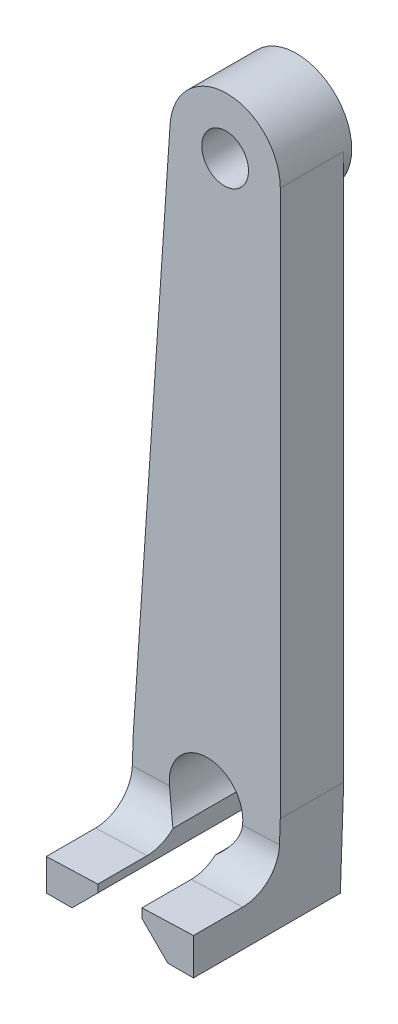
ISO-10303-21;
HEADER;
FILE_DESCRIPTION(('STEP AP214'),'2;1');
FILE_NAME('part.step','',(''),(''),'','','');
FILE_SCHEMA(('AUTOMOTIVE_DESIGN { 1 0 10303 214 1 1 1 1 }'));
ENDSEC;
DATA;
#1=APPLICATION_CONTEXT('core data for automotive mechanical design processes');
#2=APPLICATION_PROTOCOL_DEFINITION('international standard','automotive_design',2000,#1);
#3=PRODUCT_CONTEXT('',#1,'mechanical');
#4=PRODUCT('Part','Part','',(#3));
#5=PRODUCT_RELATED_PRODUCT_CATEGORY('part','',(#4));
#6=PRODUCT_DEFINITION_FORMATION('','',#4);
#7=PRODUCT_DEFINITION_CONTEXT('part definition',#1,'design');
#8=PRODUCT_DEFINITION('design','',#6,#7);
#9=PRODUCT_DEFINITION_SHAPE('','',#8);
#10=(LENGTH_UNIT() NAMED_UNIT(*) SI_UNIT(.MILLI.,.METRE.));
#11=(NAMED_UNIT(*) PLANE_ANGLE_UNIT() SI_UNIT($,.RADIAN.));
#12=(NAMED_UNIT(*) SI_UNIT($,.STERADIAN.) SOLID_ANGLE_UNIT());
#13=UNCERTAINTY_MEASURE_WITH_UNIT(LENGTH_MEASURE(1.E-05),#10,'distance_accuracy_value','');
#14=(GEOMETRIC_REPRESENTATION_CONTEXT(3) GLOBAL_UNCERTAINTY_ASSIGNED_CONTEXT((#13)) GLOBAL_UNIT_ASSIGNED_CONTEXT((#10,
#11,#12)) REPRESENTATION_CONTEXT('',''));
#15=CARTESIAN_POINT('',(0.,0.,0.));
#16=DIRECTION('',(0.,0.,1.));
#17=DIRECTION('',(1.,0.,0.));
#18=AXIS2_PLACEMENT_3D('',#15,#16,#17);
#19=CARTESIAN_POINT('',(0.,0.,25.));
#20=DIRECTION('',(0.,0.,-1.));
#21=DIRECTION('',(-1.,0.,0.));
#22=AXIS2_PLACEMENT_3D('',#19,#20,#21);
#23=CYLINDRICAL_SURFACE('',#22,3.175);
#24=CARTESIAN_POINT('',(0.,0.,10.6992327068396));
#25=DIRECTION('',(-0.00121871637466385,0.0348994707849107,0.999390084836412));
#26=DIRECTION('',(-0.0348782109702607,0.998781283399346,-0.0349207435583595));
#27=AXIS2_PLACEMENT_3D('',#24,#25,#26);
#28=ELLIPSE('',#27,3.1769376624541,3.175);
#29=CARTESIAN_POINT('',(-0.110805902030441,3.17306587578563,10.5882916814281));
#30=VERTEX_POINT('',#29);
#31=EDGE_CURVE('E233',#30,#30,#28,.T.);
#32=ORIENTED_EDGE('',*,*,#31,.T.);
#33=EDGE_LOOP('',(#32));
#34=FACE_BOUND('',#33,.T.);
#35=CARTESIAN_POINT('',(0.,0.,1.00000000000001));
#36=DIRECTION('',(0.,0.,1.));
#37=DIRECTION('',(1.,0.,0.));
#38=AXIS2_PLACEMENT_3D('',#35,#36,#37);
#39=CIRCLE('',#38,3.175);
#40=CARTESIAN_POINT('',(3.175,0.,1.00000000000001));
#41=VERTEX_POINT('',#40);
#42=EDGE_CURVE('E184',#41,#41,#39,.T.);
#43=ORIENTED_EDGE('',*,*,#42,.F.);
#44=EDGE_LOOP('',(#43));
#45=FACE_BOUND('',#44,.T.);
#46=ADVANCED_FACE('F31',(#34,#45),#23,.F.);
#47=CARTESIAN_POINT('',(-13.2423909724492,8.5499291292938,1.76926585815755));
#48=DIRECTION('',(0.00121871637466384,-0.0348994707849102,-0.999390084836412));
#49=DIRECTION('',(0.,0.999390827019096,-0.0348994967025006));
#50=AXIS2_PLACEMENT_3D('',#47,#48,#49);
#51=PLANE('',#50);
#52=CARTESIAN_POINT('',(0.,0.,2.0839845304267));
#53=DIRECTION('',(0.00121871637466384,-0.0348994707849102,-0.999390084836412));
#54=DIRECTION('',(-0.0348782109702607,0.998781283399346,-0.034920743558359));
#55=AXIS2_PLACEMENT_3D('',#52,#53,#54);
#56=ELLIPSE('',#55,7.5045771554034,7.5);
#57=CARTESIAN_POINT('',(7.49543120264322,0.261746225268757,2.0839845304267));
#58=VERTEX_POINT('',#57);
#59=CARTESIAN_POINT('',(-7.49543120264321,0.261746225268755,2.06570377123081));
#60=VERTEX_POINT('',#59);
#61=EDGE_CURVE('E165',#58,#60,#56,.T.);
#62=ORIENTED_EDGE('',*,*,#61,.F.);
#63=DIRECTION('',(0.0348782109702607,-0.998781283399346,0.034920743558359));
#64=VECTOR('',#63,1.);
#65=CARTESIAN_POINT('',(10.0248568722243,-72.1715279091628,4.61649473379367));
#66=LINE('',#65,#64);
#67=CARTESIAN_POINT('',(10.,-71.4597202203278,4.59160754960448));
#68=VERTEX_POINT('',#67);
#69=EDGE_CURVE('E173',#58,#68,#66,.T.);
#70=ORIENTED_EDGE('',*,*,#69,.T.);
#71=DIRECTION('',(0.,-0.999390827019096,0.0348994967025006));
#72=VECTOR('',#71,1.);
#73=CARTESIAN_POINT('',(10.,-72.1715289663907,4.61646445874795));
#74=LINE('',#73,#72);
#75=CARTESIAN_POINT('',(9.99999999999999,-84.3,5.03999999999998));
#76=VERTEX_POINT('',#75);
#77=EDGE_CURVE('E177',#68,#76,#74,.T.);
#78=ORIENTED_EDGE('',*,*,#77,.T.);
#79=DIRECTION('',(-0.99999925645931,0.,-0.00121945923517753));
#80=VECTOR('',#79,1.);
#81=CARTESIAN_POINT('',(6.52434559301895,-84.3,5.03576157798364));
#82=LINE('',#81,#80);
#83=CARTESIAN_POINT('',(6.5,-84.3,5.03573188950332));
#84=VERTEX_POINT('',#83);
#85=EDGE_CURVE('E392',#76,#84,#82,.T.);
#86=ORIENTED_EDGE('',*,*,#85,.T.);
#87=DIRECTION('',(-0.706876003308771,0.706876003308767,-0.0255466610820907));
#88=VECTOR('',#87,1.);
#89=CARTESIAN_POINT('',(6.86052117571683,-84.6605211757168,5.04876120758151));
#90=LINE('',#89,#88);
#91=CARTESIAN_POINT('',(3.00000000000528,-80.8000000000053,4.90924108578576));
#92=VERTEX_POINT('',#91);
#93=EDGE_CURVE('E394',#84,#92,#90,.T.);
#94=ORIENTED_EDGE('',*,*,#93,.T.);
#95=DIRECTION('',(0.,0.999390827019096,-0.0348994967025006));
#96=VECTOR('',#95,1.);
#97=CARTESIAN_POINT('',(3.00000000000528,-81.5007302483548,4.93371112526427));
#98=LINE('',#97,#96);
#99=CARTESIAN_POINT('',(3.00000000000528,-78.299999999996,4.82193916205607));
#100=VERTEX_POINT('',#99);
#101=EDGE_CURVE('E396',#92,#100,#98,.T.);
#102=ORIENTED_EDGE('',*,*,#101,.T.);
#103=CARTESIAN_POINT('',(0.,-74.3,4.67859770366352));
#104=DIRECTION('',(0.00121871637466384,-0.0348994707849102,-0.999390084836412));
#105=DIRECTION('',(-0.0348782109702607,0.998781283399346,-0.034920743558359));
#106=AXIS2_PLACEMENT_3D('',#103,#104,#105);
#107=ELLIPSE('',#106,5.0030514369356,5.);
#108=CARTESIAN_POINT('',(-3.00000000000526,-78.299999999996,4.81462240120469));
#109=VERTEX_POINT('',#108);
#110=EDGE_CURVE('E56',#100,#109,#107,.F.);
#111=ORIENTED_EDGE('',*,*,#110,.T.);
#112=DIRECTION('',(0.,-0.999390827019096,0.0348994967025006));
#113=VECTOR('',#112,1.);
#114=CARTESIAN_POINT('',(-3.00000000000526,-79.0040303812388,4.83920768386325));
#115=LINE('',#114,#113);
#116=CARTESIAN_POINT('',(-3.00000000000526,-80.8000000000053,4.90192432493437));
#117=VERTEX_POINT('',#116);
#118=EDGE_CURVE('E387',#109,#117,#115,.T.);
#119=ORIENTED_EDGE('',*,*,#118,.T.);
#120=DIRECTION('',(-0.706906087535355,-0.706906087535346,0.0238236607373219));
#121=VECTOR('',#120,1.);
#122=CARTESIAN_POINT('',(-6.83648703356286,-84.6364870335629,5.03121896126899));
#123=LINE('',#122,#121);
#124=CARTESIAN_POINT('',(-6.5,-84.3,5.01987890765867));
#125=VERTEX_POINT('',#124);
#126=EDGE_CURVE('E380',#117,#125,#123,.T.);
#127=ORIENTED_EDGE('',*,*,#126,.T.);
#128=DIRECTION('',(-0.99999925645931,0.,-0.00121945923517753));
#129=VECTOR('',#128,1.);
#130=CARTESIAN_POINT('',(-6.4756350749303,-84.3,5.01990861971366));
#131=LINE('',#130,#129);
#132=CARTESIAN_POINT('',(-10.,-84.3,5.01561079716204));
#133=VERTEX_POINT('',#132);
#134=EDGE_CURVE('E383',#125,#133,#131,.T.);
#135=ORIENTED_EDGE('',*,*,#134,.T.);
#136=DIRECTION('',(0.,0.999390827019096,-0.0348994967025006));
#137=VECTOR('',#136,1.);
#138=CARTESIAN_POINT('',(-10.,-84.9970202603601,5.03995128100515));
#139=LINE('',#138,#137);
#140=CARTESIAN_POINT('',(-10.,-71.4597202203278,4.56721834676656));
#141=VERTEX_POINT('',#140);
#142=EDGE_CURVE('E203',#133,#141,#139,.T.);
#143=ORIENTED_EDGE('',*,*,#142,.T.);
#144=DIRECTION('',(0.0348783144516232,0.99878424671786,-0.0348357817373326));
#145=VECTOR('',#144,1.);
#146=CARTESIAN_POINT('',(-10.0248261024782,-72.1706467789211,4.59201417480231));
#147=LINE('',#146,#145);
#148=EDGE_CURVE('E178',#141,#60,#147,.T.);
#149=ORIENTED_EDGE('',*,*,#148,.T.);
#150=EDGE_LOOP('',(#62,#70,#78,#86,#94,#102,#111,#119,#127,#135,#143,#149));
#151=FACE_BOUND('',#150,.T.);
#152=ADVANCED_FACE('F180',(#151),#51,.T.);
#153=CARTESIAN_POINT('',(-13.2423909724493,-80.111642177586,25.));
#154=DIRECTION('',(-0.0348994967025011,0.999390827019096,0.));
#155=DIRECTION('',(-0.999390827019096,-0.0348994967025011,0.));
#156=AXIS2_PLACEMENT_3D('',#153,#154,#155);
#157=PLANE('',#156);
#158=DIRECTION('',(0.,0.,1.));
#159=VECTOR('',#158,1.);
#160=CARTESIAN_POINT('',(3.00000000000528,-79.544445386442,25.));
#161=LINE('',#160,#159);
#162=CARTESIAN_POINT('',(3.00000000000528,-79.544445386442,18.3090882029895));
#163=VERTEX_POINT('',#162);
#164=CARTESIAN_POINT('',(3.00000000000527,-79.544445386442,25.));
#165=VERTEX_POINT('',#164);
#166=EDGE_CURVE('E441',#163,#165,#161,.T.);
#167=ORIENTED_EDGE('',*,*,#166,.T.);
#168=DIRECTION('',(0.999390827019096,0.0348994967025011,0.));
#169=VECTOR('',#168,1.);
#170=CARTESIAN_POINT('',(-13.2423909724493,-80.111642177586,25.));
#171=LINE('',#170,#169);
#172=CARTESIAN_POINT('',(10.,-79.3,25.));
#173=VERTEX_POINT('',#172);
#174=EDGE_CURVE('E351',#165,#173,#171,.T.);
#175=ORIENTED_EDGE('',*,*,#174,.T.);
#176=DIRECTION('',(0.,0.,-1.));
#177=VECTOR('',#176,1.);
#178=CARTESIAN_POINT('',(10.,-79.3,25.));
#179=LINE('',#178,#177);
#180=CARTESIAN_POINT('',(10.,-79.3,18.3090882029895));
#181=VERTEX_POINT('',#180);
#182=EDGE_CURVE('E440',#173,#181,#179,.T.);
#183=ORIENTED_EDGE('',*,*,#182,.T.);
#184=DIRECTION('',(0.999390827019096,0.0348994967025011,0.));
#185=VECTOR('',#184,1.);
#186=CARTESIAN_POINT('',(-13.2423909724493,-80.111642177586,18.3090882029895));
#187=LINE('',#186,#185);
#188=EDGE_CURVE('E419',#163,#181,#187,.T.);
#189=ORIENTED_EDGE('',*,*,#188,.F.);
#190=EDGE_LOOP('',(#167,#175,#183,#189));
#191=FACE_BOUND('',#190,.T.);
#192=ADVANCED_FACE('F253',(#191),#157,.T.);
#193=DIRECTION('',(0.,0.,1.));
#194=VECTOR('',#193,1.);
#195=CARTESIAN_POINT('',(-10.,-79.998415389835,25.));
#196=LINE('',#195,#194);
#197=CARTESIAN_POINT('',(-10.,-79.998415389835,18.3090882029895));
#198=VERTEX_POINT('',#197);
#199=CARTESIAN_POINT('',(-10.,-79.998415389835,25.));
#200=VERTEX_POINT('',#199);
#201=EDGE_CURVE('E442',#198,#200,#196,.T.);
#202=ORIENTED_EDGE('',*,*,#201,.T.);
#203=CARTESIAN_POINT('',(-3.00000000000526,-79.7539700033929,25.));
#204=VERTEX_POINT('',#203);
#205=EDGE_CURVE('E437',#200,#204,#171,.T.);
#206=ORIENTED_EDGE('',*,*,#205,.T.);
#207=DIRECTION('',(0.,0.,-1.));
#208=VECTOR('',#207,1.);
#209=CARTESIAN_POINT('',(-3.00000000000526,-79.7539700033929,25.));
#210=LINE('',#209,#208);
#211=CARTESIAN_POINT('',(-3.00000000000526,-79.7539700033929,18.3090882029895));
#212=VERTEX_POINT('',#211);
#213=EDGE_CURVE('E12',#204,#212,#210,.T.);
#214=ORIENTED_EDGE('',*,*,#213,.T.);
#215=EDGE_CURVE('E49',#198,#212,#187,.T.);
#216=ORIENTED_EDGE('',*,*,#215,.F.);
#217=EDGE_LOOP('',(#202,#206,#214,#216));
#218=FACE_BOUND('',#217,.T.);
#219=ADVANCED_FACE('F251',(#218),#157,.T.);
#220=CARTESIAN_POINT('',(-13.2423909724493,-75.111642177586,18.3090882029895));
#221=DIRECTION('',(-1.,0.,0.));
#222=DIRECTION('',(0.,-1.,0.));
#223=AXIS2_PLACEMENT_3D('',#220,#221,#222);
#224=CIRCLE('',#223,5.);
#225=DIRECTION('',(0.999390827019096,0.0348994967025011,0.));
#226=VECTOR('',#225,1.);
#227=SURFACE_OF_LINEAR_EXTRUSION('',#224,#226);
#228=CARTESIAN_POINT('',(4.98776802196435,-74.6495284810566,13.312134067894));
#229=CARTESIAN_POINT('',(4.97961202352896,-74.766334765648,13.3161743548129));
#230=CARTESIAN_POINT('',(4.96730850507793,-74.882665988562,13.3243297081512));
#231=CARTESIAN_POINT('',(4.93477954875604,-75.1132754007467,13.3484208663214));
#232=CARTESIAN_POINT('',(4.91456271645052,-75.2275556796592,13.3643482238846));
#233=CARTESIAN_POINT('',(4.86676185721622,-75.4522736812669,13.4033803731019));
#234=CARTESIAN_POINT('',(4.83924089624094,-75.5627355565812,13.4264239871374));
#235=CARTESIAN_POINT('',(4.7772594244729,-75.7800589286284,13.4791485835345));
#236=CARTESIAN_POINT('',(4.7427974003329,-75.8869196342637,13.508831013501));
#237=CARTESIAN_POINT('',(4.63013773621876,-76.2002219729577,13.6066205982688));
#238=CARTESIAN_POINT('',(4.54241007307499,-76.4005510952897,13.6836831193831));
#239=CARTESIAN_POINT('',(4.34586574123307,-76.7818667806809,13.8566570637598));
#240=CARTESIAN_POINT('',(4.23701497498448,-76.9628213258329,13.9525989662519));
#241=CARTESIAN_POINT('',(4.04084854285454,-77.2480271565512,14.1245867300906));
#242=CARTESIAN_POINT('',(3.95822922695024,-77.3579277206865,14.196794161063));
#243=CARTESIAN_POINT('',(3.78624438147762,-77.5684558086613,14.3461889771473));
#244=CARTESIAN_POINT('',(3.6968856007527,-77.6690923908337,14.423371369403));
#245=CARTESIAN_POINT('',(3.50979780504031,-77.8637083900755,14.5835511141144));
#246=CARTESIAN_POINT('',(3.41191579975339,-77.9574597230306,14.6666453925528));
#247=CARTESIAN_POINT('',(3.2102571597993,-78.1356588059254,14.8356359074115));
#248=CARTESIAN_POINT('',(3.10648033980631,-78.2201062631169,14.9215322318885));
#249=CARTESIAN_POINT('',(3.00000000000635,-78.2999999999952,15.0082080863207));
#250=B_SPLINE_CURVE_WITH_KNOTS('',3,(#228,#229,#230,#231,#232,#233,#234,#235,#236,#237,#238,
#239,#240,#241,#242,#243,#244,#245,#246,#247,#248,#249),.UNSPECIFIED.,.F.,.F.,(4,2,2,2,2,2,2,2,
2,2,4),(0.,0.351273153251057,0.702165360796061,1.05012122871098,1.39815304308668,
2.09062274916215,2.78421970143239,3.24963319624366,3.71458666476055,4.19111448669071,
4.66765729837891),.UNSPECIFIED.);
#251=CARTESIAN_POINT('',(4.98776802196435,-74.6495284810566,13.312134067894));
#252=VERTEX_POINT('',#251);
#253=CARTESIAN_POINT('',(3.00000000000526,-78.2999999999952,15.0082080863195));
#254=VERTEX_POINT('',#253);
#255=EDGE_CURVE('E286',#252,#254,#250,.T.);
#256=ORIENTED_EDGE('',*,*,#255,.T.);
#257=CARTESIAN_POINT('',(3.00000000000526,-78.2999999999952,15.0082080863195));
#258=CARTESIAN_POINT('',(3.00000000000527,-78.3914823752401,15.1122700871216));
#259=CARTESIAN_POINT('',(3.00000000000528,-78.4786165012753,15.2201509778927));
#260=CARTESIAN_POINT('',(3.00000000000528,-78.6436382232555,15.4427703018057));
#261=CARTESIAN_POINT('',(3.00000000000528,-78.721525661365,15.5575088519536));
#262=CARTESIAN_POINT('',(3.00000000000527,-78.8675026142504,15.7930625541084));
#263=CARTESIAN_POINT('',(3.00000000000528,-78.9355918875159,15.9138778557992));
#264=CARTESIAN_POINT('',(3.00000000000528,-79.0614991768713,16.16073523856));
#265=CARTESIAN_POINT('',(3.00000000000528,-79.1193178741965,16.2867769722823));
#266=CARTESIAN_POINT('',(3.00000000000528,-79.2242875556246,16.5432261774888));
#267=CARTESIAN_POINT('',(3.00000000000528,-79.2714389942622,16.6736334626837));
#268=CARTESIAN_POINT('',(3.00000000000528,-79.3547561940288,16.9379128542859));
#269=CARTESIAN_POINT('',(3.00000000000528,-79.3909202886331,17.0717854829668));
#270=CARTESIAN_POINT('',(3.00000000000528,-79.4622647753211,17.3875252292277));
#271=CARTESIAN_POINT('',(3.00000000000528,-79.4930396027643,17.5704176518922));
#272=CARTESIAN_POINT('',(3.00000000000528,-79.5238603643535,17.8464522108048));
#273=CARTESIAN_POINT('',(3.00000000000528,-79.5315770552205,17.9388081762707));
#274=CARTESIAN_POINT('',(3.00000000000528,-79.5418688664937,18.1237978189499));
#275=CARTESIAN_POINT('',(3.00000000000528,-79.5444444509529,18.2164314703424));
#276=CARTESIAN_POINT('',(3.00000000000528,-79.544445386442,18.3090882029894));
#277=B_SPLINE_CURVE_WITH_KNOTS('',3,(#257,#258,#259,#260,#261,#262,#263,#264,#265,#266,#267,
#268,#269,#270,#271,#272,#273,#274,#275,#276),.UNSPECIFIED.,.F.,.F.,(4,2,2,2,2,2,2,2,2,4),(0.,
0.41554630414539,0.831099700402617,1.24666333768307,1.66219940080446,2.07771775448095,
2.49329910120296,3.04838849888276,3.3263019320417,3.60419027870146),.UNSPECIFIED.);
#278=EDGE_CURVE('E282',#254,#163,#277,.T.);
#279=ORIENTED_EDGE('',*,*,#278,.T.);
#280=ORIENTED_EDGE('',*,*,#188,.T.);
#281=CARTESIAN_POINT('',(10.,-79.3,18.3090882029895));
#282=CARTESIAN_POINT('',(10.,-79.3000152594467,18.1682546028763));
#283=CARTESIAN_POINT('',(10.,-79.2940504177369,18.0274229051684));
#284=CARTESIAN_POINT('',(10.,-79.2702655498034,17.7467112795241));
#285=CARTESIAN_POINT('',(10.,-79.2524411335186,17.6068317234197));
#286=CARTESIAN_POINT('',(10.,-79.2051382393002,17.3296404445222));
#287=CARTESIAN_POINT('',(10.,-79.1757072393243,17.1923206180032));
#288=CARTESIAN_POINT('',(10.,-79.1054192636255,16.9207031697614));
#289=CARTESIAN_POINT('',(10.,-79.0645674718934,16.7864042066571));
#290=CARTESIAN_POINT('',(10.,-78.9722737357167,16.5232935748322));
#291=CARTESIAN_POINT('',(10.,-78.9209638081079,16.3944355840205));
#292=CARTESIAN_POINT('',(10.,-78.8078386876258,16.1414663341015));
#293=CARTESIAN_POINT('',(10.,-78.7460267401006,16.0173536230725));
#294=CARTESIAN_POINT('',(10.,-78.6123062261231,15.7746852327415));
#295=CARTESIAN_POINT('',(10.,-78.540397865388,15.6561294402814));
#296=CARTESIAN_POINT('',(10.,-78.3869854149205,15.4253794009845));
#297=CARTESIAN_POINT('',(10.,-78.3054779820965,15.3131873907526));
#298=CARTESIAN_POINT('',(10.,-78.0474356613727,14.9874464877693));
#299=CARTESIAN_POINT('',(10.,-77.8572399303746,14.78447774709));
#300=CARTESIAN_POINT('',(10.,-77.445840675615,14.4128691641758));
#301=CARTESIAN_POINT('',(10.,-77.2246371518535,14.2442293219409));
#302=CARTESIAN_POINT('',(10.,-76.874415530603,14.0205384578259));
#303=CARTESIAN_POINT('',(10.,-76.7545391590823,13.9508246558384));
#304=CARTESIAN_POINT('',(10.,-76.5094277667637,13.8215949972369));
#305=CARTESIAN_POINT('',(10.,-76.3841945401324,13.7620757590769));
#306=CARTESIAN_POINT('',(10.,-76.1183153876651,13.649007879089));
#307=CARTESIAN_POINT('',(10.,-75.9772670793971,13.5964046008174));
#308=CARTESIAN_POINT('',(10.,-75.6909903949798,13.5041147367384));
#309=CARTESIAN_POINT('',(10.,-75.5457615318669,13.4644296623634));
#310=CARTESIAN_POINT('',(10.,-75.2472567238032,13.3971747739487));
#311=CARTESIAN_POINT('',(10.,-75.0938759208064,13.3700694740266));
#312=CARTESIAN_POINT('',(10.,-74.785247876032,13.3302522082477));
#313=CARTESIAN_POINT('',(10.,-74.6300005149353,13.3175411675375));
#314=CARTESIAN_POINT('',(10.,-74.4744974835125,13.312134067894));
#315=B_SPLINE_CURVE_WITH_KNOTS('',3,(#281,#282,#283,#284,#285,#286,#287,#288,#289,#290,#291,
#292,#293,#294,#295,#296,#297,#298,#299,#300,#301,#302,#303,#304,#305,#306,#307,#308,#309,#310,
#311,#312,#313,#314),.UNSPECIFIED.,.F.,.F.,(4,2,2,2,2,2,2,2,2,2,2,2,2,2,2,2,4),(0.,
0.422372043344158,0.844900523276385,1.26571824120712,1.68634525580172,2.10195920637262,
2.51744495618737,2.93292224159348,3.3485446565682,4.17892646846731,5.0093082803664,
5.42492719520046,5.84040798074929,6.29140663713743,6.74245804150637,7.20904953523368,
7.67567101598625),.UNSPECIFIED.);
#316=CARTESIAN_POINT('',(10.,-74.4744974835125,13.312134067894));
#317=VERTEX_POINT('',#316);
#318=EDGE_CURVE('E276',#181,#317,#315,.T.);
#319=ORIENTED_EDGE('',*,*,#318,.T.);
#320=DIRECTION('',(0.999390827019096,0.0348994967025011,0.));
#321=VECTOR('',#320,1.);
#322=CARTESIAN_POINT('',(-13.2423909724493,-75.2861396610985,13.312134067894));
#323=LINE('',#322,#321);
#324=EDGE_CURVE('E187',#252,#317,#323,.T.);
#325=ORIENTED_EDGE('',*,*,#324,.F.);
#326=EDGE_LOOP('',(#256,#279,#280,#319,#325));
#327=FACE_BOUND('',#326,.T.);
#328=ADVANCED_FACE('F245',(#327),#227,.T.);
#329=CARTESIAN_POINT('',(-10.,-75.1729128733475,13.312134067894));
#330=CARTESIAN_POINT('',(-10.,-75.3113897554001,13.3169556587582));
#331=CARTESIAN_POINT('',(-10.,-75.4496623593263,13.3275610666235));
#332=CARTESIAN_POINT('',(-10.,-75.7248458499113,13.3602036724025));
#333=CARTESIAN_POINT('',(-10.,-75.8617567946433,13.3822403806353));
#334=CARTESIAN_POINT('',(-10.,-76.1332795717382,13.4376109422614));
#335=CARTESIAN_POINT('',(-10.,-76.2678913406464,13.4709451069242));
#336=CARTESIAN_POINT('',(-10.,-76.5338786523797,13.5486732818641));
#337=CARTESIAN_POINT('',(-10.,-76.6652542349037,13.5930671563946));
#338=CARTESIAN_POINT('',(-10.,-76.9238494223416,13.6926082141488));
#339=CARTESIAN_POINT('',(-10.,-77.0510697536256,13.7477535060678));
#340=CARTESIAN_POINT('',(-10.,-77.3005125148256,13.8684153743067));
#341=CARTESIAN_POINT('',(-10.,-77.4227331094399,13.9339357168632));
#342=CARTESIAN_POINT('',(-10.,-77.7804938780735,14.1453618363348));
#343=CARTESIAN_POINT('',(-10.,-78.0074066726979,14.3062383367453));
#344=CARTESIAN_POINT('',(-10.,-78.4314315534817,14.6633734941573));
#345=CARTESIAN_POINT('',(-10.,-78.6285436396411,14.8596321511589));
#346=CARTESIAN_POINT('',(-10.,-78.8977143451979,15.1762391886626));
#347=CARTESIAN_POINT('',(-10.,-78.9830590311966,15.2855404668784));
#348=CARTESIAN_POINT('',(-10.,-79.1443723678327,15.5108377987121));
#349=CARTESIAN_POINT('',(-10.,-79.2203442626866,15.6268315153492));
#350=CARTESIAN_POINT('',(-10.,-79.3623892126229,15.864720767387));
#351=CARTESIAN_POINT('',(-10.,-79.4284622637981,15.9866163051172));
#352=CARTESIAN_POINT('',(-10.,-79.5502819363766,16.235512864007));
#353=CARTESIAN_POINT('',(-10.,-79.6060249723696,16.3625156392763));
#354=CARTESIAN_POINT('',(-10.,-79.7125709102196,16.63558499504));
#355=CARTESIAN_POINT('',(-10.,-79.7620670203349,16.782163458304));
#356=CARTESIAN_POINT('',(-10.,-79.8473001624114,17.0793584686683));
#357=CARTESIAN_POINT('',(-10.,-79.8830288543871,17.2299774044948));
#358=CARTESIAN_POINT('',(-10.,-79.9405269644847,17.5346954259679));
#359=CARTESIAN_POINT('',(-10.,-79.9622204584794,17.6888088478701));
#360=CARTESIAN_POINT('',(-10.,-79.9911726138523,17.9983104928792));
#361=CARTESIAN_POINT('',(-10.,-79.9984381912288,18.1536980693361));
#362=CARTESIAN_POINT('',(-10.,-79.998415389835,18.3090882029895));
#363=B_SPLINE_CURVE_WITH_KNOTS('',3,(#329,#330,#331,#332,#333,#334,#335,#336,#337,#338,#339,
#340,#341,#342,#343,#344,#345,#346,#347,#348,#349,#350,#351,#352,#353,#354,#355,#356,#357,#358,
#359,#360,#361,#362),.UNSPECIFIED.,.F.,.F.,(4,2,2,2,2,2,2,2,2,2,2,2,2,2,2,2,4),(0.,
0.415558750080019,0.831099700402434,1.24665210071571,1.66219940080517,2.07767366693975,
2.49329910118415,3.32368091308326,4.15406272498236,4.5696847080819,4.98516242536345,
5.40064030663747,5.81626212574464,6.27971495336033,6.74344809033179,7.20966929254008,
7.67566695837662),.UNSPECIFIED.);
#364=CARTESIAN_POINT('',(-10.,-75.1729128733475,13.312134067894));
#365=VERTEX_POINT('',#364);
#366=EDGE_CURVE('E270',#365,#198,#363,.T.);
#367=ORIENTED_EDGE('',*,*,#366,.T.);
#368=ORIENTED_EDGE('',*,*,#215,.T.);
#369=CARTESIAN_POINT('',(-3.00000000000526,-79.7539700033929,18.3090882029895));
#370=CARTESIAN_POINT('',(-3.00000000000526,-79.7539853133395,18.1682221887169));
#371=CARTESIAN_POINT('',(-3.00000000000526,-79.7480176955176,18.02735798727));
#372=CARTESIAN_POINT('',(-3.00000000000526,-79.7242217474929,17.7465810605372));
#373=CARTESIAN_POINT('',(-3.00000000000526,-79.7063889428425,17.6066687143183));
#374=CARTESIAN_POINT('',(-3.00000000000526,-79.6590749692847,17.3294783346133));
#375=CARTESIAN_POINT('',(-3.00000000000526,-79.6296467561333,17.1921912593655));
#376=CARTESIAN_POINT('',(-3.00000000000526,-79.559369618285,16.9206387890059));
#377=CARTESIAN_POINT('',(-3.00000000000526,-79.5185259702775,16.7863720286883));
#378=CARTESIAN_POINT('',(-3.00000000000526,-79.4262483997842,16.5233062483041));
#379=CARTESIAN_POINT('',(-3.00000000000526,-79.3749448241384,16.3944614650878));
#380=CARTESIAN_POINT('',(-3.00000000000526,-79.2618186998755,16.1414874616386));
#381=CARTESIAN_POINT('',(-3.00000000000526,-79.1999974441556,16.0173576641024));
#382=CARTESIAN_POINT('',(-3.00000000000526,-79.077160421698,15.7944349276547));
#383=CARTESIAN_POINT('',(-3.00000000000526,-79.0176523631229,15.6948073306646));
#384=CARTESIAN_POINT('',(-3.00000000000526,-78.8918361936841,15.4999032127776));
#385=CARTESIAN_POINT('',(-3.00000000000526,-78.8255264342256,15.4046277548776));
#386=CARTESIAN_POINT('',(-3.00000000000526,-78.6862405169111,15.2186546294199));
#387=CARTESIAN_POINT('',(-3.00000000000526,-78.613245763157,15.127970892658));
#388=CARTESIAN_POINT('',(-3.00000000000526,-78.4611295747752,14.9519292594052));
#389=CARTESIAN_POINT('',(-3.00000000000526,-78.3820094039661,14.8665702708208));
#390=CARTESIAN_POINT('',(-3.00000000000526,-78.2999999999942,14.784081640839));
#391=B_SPLINE_CURVE_WITH_KNOTS('',3,(#369,#370,#371,#372,#373,#374,#375,#376,#377,#378,#379,
#380,#381,#382,#383,#384,#385,#386,#387,#388,#389,#390),.UNSPECIFIED.,.F.,.F.,(4,2,2,2,2,2,2,2,
2,2,4),(0.,0.422469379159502,0.84509816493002,1.2658187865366,1.68634525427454,2.10192062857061,
2.51744495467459,2.86531458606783,3.21326873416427,3.56222203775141,3.91110353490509),.UNSPECIFIED.);
#392=CARTESIAN_POINT('',(-3.00000000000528,-78.299999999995,14.7840816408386));
#393=VERTEX_POINT('',#392);
#394=EDGE_CURVE('E41',#212,#393,#391,.T.);
#395=ORIENTED_EDGE('',*,*,#394,.T.);
#396=CARTESIAN_POINT('',(-3.00000000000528,-78.299999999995,14.7840816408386));
#397=CARTESIAN_POINT('',(-3.10191880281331,-78.223539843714,14.7035829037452));
#398=CARTESIAN_POINT('',(-3.20158681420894,-78.1427201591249,14.6242657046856));
#399=CARTESIAN_POINT('',(-3.39580750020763,-77.9722241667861,14.4691035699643));
#400=CARTESIAN_POINT('',(-3.4903623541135,-77.882551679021,14.393257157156));
#401=CARTESIAN_POINT('',(-3.67345361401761,-77.6945351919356,14.2463779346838));
#402=CARTESIAN_POINT('',(-3.76201320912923,-77.5962284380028,14.1753265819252));
#403=CARTESIAN_POINT('',(-3.93287518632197,-77.3903741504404,14.0387268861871));
#404=CARTESIAN_POINT('',(-4.01516745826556,-77.2828122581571,13.973187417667));
#405=CARTESIAN_POINT('',(-4.16158012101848,-77.0740229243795,13.8575023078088));
#406=CARTESIAN_POINT('',(-4.22664556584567,-76.9739462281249,13.8064777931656));
#407=CARTESIAN_POINT('',(-4.35052638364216,-76.767271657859,13.7104227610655));
#408=CARTESIAN_POINT('',(-4.40934333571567,-76.6606754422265,13.6653907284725));
#409=CARTESIAN_POINT('',(-4.51985984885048,-76.4414718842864,13.5822726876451));
#410=CARTESIAN_POINT('',(-4.57157052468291,-76.3288743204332,13.5441758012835));
#411=CARTESIAN_POINT('',(-4.66713043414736,-76.0981878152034,13.4757597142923));
#412=CARTESIAN_POINT('',(-4.71098394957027,-75.9801019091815,13.4454362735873));
#413=CARTESIAN_POINT('',(-4.79604047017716,-75.7210013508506,13.3894603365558));
#414=CARTESIAN_POINT('',(-4.83584869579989,-75.5792126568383,13.3651999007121));
#415=CARTESIAN_POINT('',(-4.88623802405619,-75.3631009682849,13.3381471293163));
#416=CARTESIAN_POINT('',(-4.90149385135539,-75.2903992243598,13.3306823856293));
#417=CARTESIAN_POINT('',(-4.92879575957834,-75.1441051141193,13.3189707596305));
#418=CARTESIAN_POINT('',(-4.9408403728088,-75.0705123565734,13.3147253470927));
#419=CARTESIAN_POINT('',(-4.95123619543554,-74.99660615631,13.312134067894));
#420=B_SPLINE_CURVE_WITH_KNOTS('',3,(#396,#397,#398,#399,#400,#401,#402,#403,#404,#405,#406,
#407,#408,#409,#410,#411,#412,#413,#414,#415,#416,#417,#418,#419),.UNSPECIFIED.,.F.,.F.,(4,2,2,
2,2,2,2,2,2,2,2,4),(0.,0.452135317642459,0.904076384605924,1.3541556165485,1.80494615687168,
2.19398354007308,2.58292237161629,2.97124577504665,3.35935691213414,3.80594203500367,
4.0297951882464,4.25375047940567),.UNSPECIFIED.);
#421=CARTESIAN_POINT('',(-4.95123619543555,-74.99660615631,13.312134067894));
#422=VERTEX_POINT('',#421);
#423=EDGE_CURVE('E263',#393,#422,#420,.T.);
#424=ORIENTED_EDGE('',*,*,#423,.T.);
#425=EDGE_CURVE('E421',#365,#422,#323,.T.);
#426=ORIENTED_EDGE('',*,*,#425,.F.);
#427=EDGE_LOOP('',(#367,#368,#395,#424,#426));
#428=FACE_BOUND('',#427,.T.);
#429=ADVANCED_FACE('F250',(#428),#227,.T.);
#430=CARTESIAN_POINT('',(-13.2423909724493,-75.2861396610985,13.312134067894));
#431=DIRECTION('',(-0.00121871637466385,0.0348994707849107,0.999390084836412));
#432=DIRECTION('',(0.,-0.999390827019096,0.0348994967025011));
#433=AXIS2_PLACEMENT_3D('',#430,#431,#432);
#434=PLANE('',#433);
#435=ORIENTED_EDGE('',*,*,#31,.F.);
#436=EDGE_LOOP('',(#435));
#437=FACE_BOUND('',#436,.T.);
#438=CARTESIAN_POINT('',(0.,-74.3,13.2938458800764));
#439=DIRECTION('',(-0.00121871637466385,0.0348994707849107,0.999390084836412));
#440=DIRECTION('',(-0.0348782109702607,0.998781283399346,-0.0349207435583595));
#441=AXIS2_PLACEMENT_3D('',#438,#439,#440);
#442=ELLIPSE('',#441,5.0030514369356,5.);
#443=EDGE_CURVE('E406',#422,#252,#442,.F.);
#444=ORIENTED_EDGE('',*,*,#443,.T.);
#445=ORIENTED_EDGE('',*,*,#324,.T.);
#446=DIRECTION('',(0.,0.999390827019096,-0.0348994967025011));
#447=VECTOR('',#446,1.);
#448=CARTESIAN_POINT('',(10.,-71.8710442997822,13.2212194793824));
#449=LINE('',#448,#447);
#450=CARTESIAN_POINT('',(10.,-71.4597202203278,13.2068557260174));
#451=VERTEX_POINT('',#450);
#452=EDGE_CURVE('E405',#317,#451,#449,.T.);
#453=ORIENTED_EDGE('',*,*,#452,.T.);
#454=DIRECTION('',(-0.0348782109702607,0.998781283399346,-0.0349207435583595));
#455=VECTOR('',#454,1.);
#456=CARTESIAN_POINT('',(10.014363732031,-71.871043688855,13.2212369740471));
#457=LINE('',#456,#455);
#458=CARTESIAN_POINT('',(7.49543120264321,0.261746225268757,10.6992327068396));
#459=VERTEX_POINT('',#458);
#460=EDGE_CURVE('E403',#451,#459,#457,.T.);
#461=ORIENTED_EDGE('',*,*,#460,.T.);
#462=CARTESIAN_POINT('',(0.,0.,10.6992327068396));
#463=DIRECTION('',(-0.00121871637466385,0.0348994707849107,0.999390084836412));
#464=DIRECTION('',(-0.0348782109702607,0.998781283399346,-0.0349207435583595));
#465=AXIS2_PLACEMENT_3D('',#462,#463,#464);
#466=ELLIPSE('',#465,7.50457715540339,7.49999999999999);
#467=CARTESIAN_POINT('',(-7.49543120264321,0.261746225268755,10.6809519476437));
#468=VERTEX_POINT('',#467);
#469=EDGE_CURVE('E166',#459,#468,#466,.T.);
#470=ORIENTED_EDGE('',*,*,#469,.T.);
#471=DIRECTION('',(-0.0348783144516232,-0.99878424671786,0.0348357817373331));
#472=VECTOR('',#471,1.);
#473=CARTESIAN_POINT('',(-10.0143584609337,-71.8708927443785,13.1968074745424));
#474=LINE('',#473,#472);
#475=CARTESIAN_POINT('',(-10.,-71.4597202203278,13.1824665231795));
#476=VERTEX_POINT('',#475);
#477=EDGE_CURVE('E400',#468,#476,#474,.T.);
#478=ORIENTED_EDGE('',*,*,#477,.T.);
#479=DIRECTION('',(0.,-0.999390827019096,0.0348994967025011));
#480=VECTOR('',#479,1.);
#481=CARTESIAN_POINT('',(-10.,-84.6965355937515,13.6447063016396));
#482=LINE('',#481,#480);
#483=EDGE_CURVE('E235',#476,#365,#482,.T.);
#484=ORIENTED_EDGE('',*,*,#483,.T.);
#485=ORIENTED_EDGE('',*,*,#425,.T.);
#486=EDGE_LOOP('',(#444,#445,#453,#461,#470,#478,#484,#485));
#487=FACE_BOUND('',#486,.T.);
#488=ADVANCED_FACE('F255',(#437,#487),#434,.T.);
#489=CARTESIAN_POINT('',(0.,-74.3,25.));
#490=DIRECTION('',(0.,0.,1.));
#491=DIRECTION('',(1.,0.,0.));
#492=AXIS2_PLACEMENT_3D('',#489,#490,#491);
#493=PLANE('',#492);
#494=DIRECTION('',(0.,1.,0.));
#495=VECTOR('',#494,1.);
#496=CARTESIAN_POINT('',(10.,-71.4597202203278,25.));
#497=LINE('',#496,#495);
#498=CARTESIAN_POINT('',(10.,-84.3,25.));
#499=VERTEX_POINT('',#498);
#500=EDGE_CURVE('E350',#499,#173,#497,.T.);
#501=ORIENTED_EDGE('',*,*,#500,.T.);
#502=ORIENTED_EDGE('',*,*,#174,.F.);
#503=DIRECTION('',(0.,-1.,0.));
#504=VECTOR('',#503,1.);
#505=CARTESIAN_POINT('',(3.00000000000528,-80.8000000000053,25.));
#506=LINE('',#505,#504);
#507=CARTESIAN_POINT('',(3.00000000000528,-80.8000000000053,25.));
#508=VERTEX_POINT('',#507);
#509=EDGE_CURVE('E444',#165,#508,#506,.T.);
#510=ORIENTED_EDGE('',*,*,#509,.T.);
#511=DIRECTION('',(0.707106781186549,-0.707106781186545,0.));
#512=VECTOR('',#511,1.);
#513=CARTESIAN_POINT('',(6.5,-84.3,25.));
#514=LINE('',#513,#512);
#515=CARTESIAN_POINT('',(6.5,-84.3,25.));
#516=VERTEX_POINT('',#515);
#517=EDGE_CURVE('E361',#508,#516,#514,.T.);
#518=ORIENTED_EDGE('',*,*,#517,.T.);
#519=DIRECTION('',(1.,0.,0.));
#520=VECTOR('',#519,1.);
#521=CARTESIAN_POINT('',(6.5,-84.3,25.));
#522=LINE('',#521,#520);
#523=EDGE_CURVE('E354',#516,#499,#522,.T.);
#524=ORIENTED_EDGE('',*,*,#523,.T.);
#525=EDGE_LOOP('',(#501,#502,#510,#518,#524));
#526=FACE_BOUND('',#525,.T.);
#527=ADVANCED_FACE('F337',(#526),#493,.T.);
#528=DIRECTION('',(0.,1.,0.));
#529=VECTOR('',#528,1.);
#530=CARTESIAN_POINT('',(-3.00000000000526,-78.299999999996,25.));
#531=LINE('',#530,#529);
#532=CARTESIAN_POINT('',(-3.00000000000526,-80.8000000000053,25.));
#533=VERTEX_POINT('',#532);
#534=EDGE_CURVE('E368',#533,#204,#531,.T.);
#535=ORIENTED_EDGE('',*,*,#534,.T.);
#536=ORIENTED_EDGE('',*,*,#205,.F.);
#537=DIRECTION('',(0.,-1.,0.));
#538=VECTOR('',#537,1.);
#539=CARTESIAN_POINT('',(-10.,-84.3,25.));
#540=LINE('',#539,#538);
#541=CARTESIAN_POINT('',(-10.,-84.3,25.));
#542=VERTEX_POINT('',#541);
#543=EDGE_CURVE('E357',#200,#542,#540,.T.);
#544=ORIENTED_EDGE('',*,*,#543,.T.);
#545=DIRECTION('',(1.,0.,0.));
#546=VECTOR('',#545,1.);
#547=CARTESIAN_POINT('',(-6.5,-84.3,25.));
#548=LINE('',#547,#546);
#549=CARTESIAN_POINT('',(-6.5,-84.3,25.));
#550=VERTEX_POINT('',#549);
#551=EDGE_CURVE('E359',#542,#550,#548,.T.);
#552=ORIENTED_EDGE('',*,*,#551,.T.);
#553=DIRECTION('',(0.707106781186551,0.707106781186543,0.));
#554=VECTOR('',#553,1.);
#555=CARTESIAN_POINT('',(-6.5,-84.3,25.));
#556=LINE('',#555,#554);
#557=EDGE_CURVE('E366',#550,#533,#556,.T.);
#558=ORIENTED_EDGE('',*,*,#557,.T.);
#559=EDGE_LOOP('',(#535,#536,#544,#552,#558));
#560=FACE_BOUND('',#559,.T.);
#561=ADVANCED_FACE('F339',(#560),#493,.T.);
#562=CARTESIAN_POINT('',(0.,-74.3,25.));
#563=DIRECTION('',(0.,0.,-1.));
#564=DIRECTION('',(-1.,0.,0.));
#565=AXIS2_PLACEMENT_3D('',#562,#563,#564);
#566=CYLINDRICAL_SURFACE('',#565,5.);
#567=ORIENTED_EDGE('',*,*,#423,.F.);
#568=DIRECTION('',(0.,0.,-1.));
#569=VECTOR('',#568,1.);
#570=CARTESIAN_POINT('',(-3.00000000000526,-78.299999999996,25.));
#571=LINE('',#570,#569);
#572=EDGE_CURVE('E371',#393,#109,#571,.T.);
#573=ORIENTED_EDGE('',*,*,#572,.T.);
#574=ORIENTED_EDGE('',*,*,#110,.F.);
#575=DIRECTION('',(0.,0.,-1.));
#576=VECTOR('',#575,1.);
#577=CARTESIAN_POINT('',(3.00000000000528,-78.299999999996,25.));
#578=LINE('',#577,#576);
#579=EDGE_CURVE('E230',#254,#100,#578,.T.);
#580=ORIENTED_EDGE('',*,*,#579,.F.);
#581=ORIENTED_EDGE('',*,*,#255,.F.);
#582=ORIENTED_EDGE('',*,*,#443,.F.);
#583=EDGE_LOOP('',(#567,#573,#574,#580,#581,#582));
#584=FACE_BOUND('',#583,.T.);
#585=ADVANCED_FACE('F33',(#584),#566,.F.);
#586=CARTESIAN_POINT('',(3.00000000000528,-80.8000000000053,25.));
#587=DIRECTION('',(1.,0.,0.));
#588=DIRECTION('',(0.,1.,0.));
#589=AXIS2_PLACEMENT_3D('',#586,#587,#588);
#590=PLANE('',#589);
#591=ORIENTED_EDGE('',*,*,#166,.F.);
#592=ORIENTED_EDGE('',*,*,#278,.F.);
#593=ORIENTED_EDGE('',*,*,#579,.T.);
#594=ORIENTED_EDGE('',*,*,#101,.F.);
#595=DIRECTION('',(0.,0.,-1.));
#596=VECTOR('',#595,1.);
#597=CARTESIAN_POINT('',(3.00000000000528,-80.8000000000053,25.));
#598=LINE('',#597,#596);
#599=EDGE_CURVE('E227',#508,#92,#598,.T.);
#600=ORIENTED_EDGE('',*,*,#599,.F.);
#601=ORIENTED_EDGE('',*,*,#509,.F.);
#602=EDGE_LOOP('',(#591,#592,#593,#594,#600,#601));
#603=FACE_BOUND('',#602,.T.);
#604=ADVANCED_FACE('F291',(#603),#590,.F.);
#605=CARTESIAN_POINT('',(6.5,-84.3,25.));
#606=DIRECTION('',(0.707106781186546,0.707106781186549,0.));
#607=DIRECTION('',(-0.707106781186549,0.707106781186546,0.));
#608=AXIS2_PLACEMENT_3D('',#605,#606,#607);
#609=PLANE('',#608);
#610=ORIENTED_EDGE('',*,*,#93,.F.);
#611=DIRECTION('',(0.,0.,-1.));
#612=VECTOR('',#611,1.);
#613=CARTESIAN_POINT('',(6.5,-84.3,25.));
#614=LINE('',#613,#612);
#615=EDGE_CURVE('E224',#516,#84,#614,.T.);
#616=ORIENTED_EDGE('',*,*,#615,.F.);
#617=ORIENTED_EDGE('',*,*,#517,.F.);
#618=ORIENTED_EDGE('',*,*,#599,.T.);
#619=EDGE_LOOP('',(#610,#616,#617,#618));
#620=FACE_BOUND('',#619,.T.);
#621=ADVANCED_FACE('F295',(#620),#609,.F.);
#622=CARTESIAN_POINT('',(6.5,-84.3,25.));
#623=DIRECTION('',(0.,1.,0.));
#624=DIRECTION('',(0.,0.,1.));
#625=AXIS2_PLACEMENT_3D('',#622,#623,#624);
#626=PLANE('',#625);
#627=ORIENTED_EDGE('',*,*,#85,.F.);
#628=DIRECTION('',(0.,0.,-1.));
#629=VECTOR('',#628,1.);
#630=CARTESIAN_POINT('',(10.,-84.3,25.));
#631=LINE('',#630,#629);
#632=EDGE_CURVE('E221',#499,#76,#631,.T.);
#633=ORIENTED_EDGE('',*,*,#632,.F.);
#634=ORIENTED_EDGE('',*,*,#523,.F.);
#635=ORIENTED_EDGE('',*,*,#615,.T.);
#636=EDGE_LOOP('',(#627,#633,#634,#635));
#637=FACE_BOUND('',#636,.T.);
#638=ADVANCED_FACE('F299',(#637),#626,.F.);
#639=CARTESIAN_POINT('',(10.,-71.4597202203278,25.));
#640=DIRECTION('',(-1.,0.,0.));
#641=DIRECTION('',(0.,-1.,0.));
#642=AXIS2_PLACEMENT_3D('',#639,#640,#641);
#643=PLANE('',#642);
#644=ORIENTED_EDGE('',*,*,#182,.F.);
#645=ORIENTED_EDGE('',*,*,#500,.F.);
#646=ORIENTED_EDGE('',*,*,#632,.T.);
#647=ORIENTED_EDGE('',*,*,#77,.F.);
#648=DIRECTION('',(0.,0.,-1.));
#649=VECTOR('',#648,1.);
#650=CARTESIAN_POINT('',(10.,-71.4597202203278,25.));
#651=LINE('',#650,#649);
#652=EDGE_CURVE('E169',#451,#68,#651,.T.);
#653=ORIENTED_EDGE('',*,*,#652,.F.);
#654=ORIENTED_EDGE('',*,*,#452,.F.);
#655=ORIENTED_EDGE('',*,*,#318,.F.);
#656=EDGE_LOOP('',(#644,#645,#646,#647,#653,#654,#655));
#657=FACE_BOUND('',#656,.T.);
#658=ADVANCED_FACE('F302',(#657),#643,.F.);
#659=CARTESIAN_POINT('',(10.,-71.4597202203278,25.));
#660=DIRECTION('',(-0.999390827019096,-0.0348994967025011,0.));
#661=DIRECTION('',(0.0348994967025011,-0.999390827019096,0.));
#662=AXIS2_PLACEMENT_3D('',#659,#660,#661);
#663=PLANE('',#662);
#664=ORIENTED_EDGE('',*,*,#460,.F.);
#665=ORIENTED_EDGE('',*,*,#652,.T.);
#666=ORIENTED_EDGE('',*,*,#69,.F.);
#667=DIRECTION('',(0.,0.,-1.));
#668=VECTOR('',#667,1.);
#669=CARTESIAN_POINT('',(7.49543120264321,0.261746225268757,25.));
#670=LINE('',#669,#668);
#671=EDGE_CURVE('E159',#459,#58,#670,.T.);
#672=ORIENTED_EDGE('',*,*,#671,.F.);
#673=EDGE_LOOP('',(#664,#665,#666,#672));
#674=FACE_BOUND('',#673,.T.);
#675=ADVANCED_FACE('F174',(#674),#663,.F.);
#676=CARTESIAN_POINT('',(0.,0.,25.));
#677=DIRECTION('',(0.,0.,-1.));
#678=DIRECTION('',(-1.,0.,0.));
#679=AXIS2_PLACEMENT_3D('',#676,#677,#678);
#680=CYLINDRICAL_SURFACE('',#679,7.49999999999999);
#681=ORIENTED_EDGE('',*,*,#469,.F.);
#682=ORIENTED_EDGE('',*,*,#671,.T.);
#683=ORIENTED_EDGE('',*,*,#61,.T.);
#684=DIRECTION('',(0.,0.,-1.));
#685=VECTOR('',#684,1.);
#686=CARTESIAN_POINT('',(-7.49543120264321,0.261746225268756,25.));
#687=LINE('',#686,#685);
#688=EDGE_CURVE('E170',#468,#60,#687,.T.);
#689=ORIENTED_EDGE('',*,*,#688,.F.);
#690=EDGE_LOOP('',(#681,#682,#683,#689));
#691=FACE_BOUND('',#690,.T.);
#692=CARTESIAN_POINT('',(0.,0.,1.00000000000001));
#693=DIRECTION('',(0.,0.,1.));
#694=DIRECTION('',(1.,0.,0.));
#695=AXIS2_PLACEMENT_3D('',#692,#693,#694);
#696=CIRCLE('',#695,7.5);
#697=CARTESIAN_POINT('',(7.5,0.,1.00000000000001));
#698=VERTEX_POINT('',#697);
#699=EDGE_CURVE('E183',#698,#698,#696,.T.);
#700=ORIENTED_EDGE('',*,*,#699,.T.);
#701=EDGE_LOOP('',(#700));
#702=FACE_BOUND('',#701,.T.);
#703=ADVANCED_FACE('F161',(#691,#702),#680,.T.);
#704=CARTESIAN_POINT('',(-10.,-71.4597202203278,25.));
#705=DIRECTION('',(0.999390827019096,-0.0348994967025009,0.));
#706=DIRECTION('',(0.0348994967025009,0.999390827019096,0.));
#707=AXIS2_PLACEMENT_3D('',#704,#705,#706);
#708=PLANE('',#707);
#709=ORIENTED_EDGE('',*,*,#477,.F.);
#710=ORIENTED_EDGE('',*,*,#688,.T.);
#711=ORIENTED_EDGE('',*,*,#148,.F.);
#712=DIRECTION('',(0.,0.,-1.));
#713=VECTOR('',#712,1.);
#714=CARTESIAN_POINT('',(-10.,-71.4597202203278,25.));
#715=LINE('',#714,#713);
#716=EDGE_CURVE('E205',#476,#141,#715,.T.);
#717=ORIENTED_EDGE('',*,*,#716,.F.);
#718=EDGE_LOOP('',(#709,#710,#711,#717));
#719=FACE_BOUND('',#718,.T.);
#720=ADVANCED_FACE('F312',(#719),#708,.F.);
#721=CARTESIAN_POINT('',(-10.,-84.3,25.));
#722=DIRECTION('',(1.,0.,0.));
#723=DIRECTION('',(0.,0.,-1.));
#724=AXIS2_PLACEMENT_3D('',#721,#722,#723);
#725=PLANE('',#724);
#726=ORIENTED_EDGE('',*,*,#201,.F.);
#727=ORIENTED_EDGE('',*,*,#366,.F.);
#728=ORIENTED_EDGE('',*,*,#483,.F.);
#729=ORIENTED_EDGE('',*,*,#716,.T.);
#730=ORIENTED_EDGE('',*,*,#142,.F.);
#731=DIRECTION('',(0.,0.,-1.));
#732=VECTOR('',#731,1.);
#733=CARTESIAN_POINT('',(-10.,-84.3,25.));
#734=LINE('',#733,#732);
#735=EDGE_CURVE('E209',#542,#133,#734,.T.);
#736=ORIENTED_EDGE('',*,*,#735,.F.);
#737=ORIENTED_EDGE('',*,*,#543,.F.);
#738=EDGE_LOOP('',(#726,#727,#728,#729,#730,#736,#737));
#739=FACE_BOUND('',#738,.T.);
#740=ADVANCED_FACE('F314',(#739),#725,.F.);
#741=CARTESIAN_POINT('',(-6.5,-84.3,25.));
#742=DIRECTION('',(0.,1.,0.));
#743=DIRECTION('',(0.,0.,1.));
#744=AXIS2_PLACEMENT_3D('',#741,#742,#743);
#745=PLANE('',#744);
#746=ORIENTED_EDGE('',*,*,#134,.F.);
#747=DIRECTION('',(0.,0.,-1.));
#748=VECTOR('',#747,1.);
#749=CARTESIAN_POINT('',(-6.5,-84.3,25.));
#750=LINE('',#749,#748);
#751=EDGE_CURVE('E216',#550,#125,#750,.T.);
#752=ORIENTED_EDGE('',*,*,#751,.F.);
#753=ORIENTED_EDGE('',*,*,#551,.F.);
#754=ORIENTED_EDGE('',*,*,#735,.T.);
#755=EDGE_LOOP('',(#746,#752,#753,#754));
#756=FACE_BOUND('',#755,.T.);
#757=ADVANCED_FACE('F318',(#756),#745,.F.);
#758=CARTESIAN_POINT('',(-6.5,-84.3,25.));
#759=DIRECTION('',(-0.707106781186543,0.707106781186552,0.));
#760=DIRECTION('',(-0.707106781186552,-0.707106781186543,0.));
#761=AXIS2_PLACEMENT_3D('',#758,#759,#760);
#762=PLANE('',#761);
#763=ORIENTED_EDGE('',*,*,#126,.F.);
#764=DIRECTION('',(0.,0.,-1.));
#765=VECTOR('',#764,1.);
#766=CARTESIAN_POINT('',(-3.00000000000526,-80.8000000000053,25.));
#767=LINE('',#766,#765);
#768=EDGE_CURVE('E374',#533,#117,#767,.T.);
#769=ORIENTED_EDGE('',*,*,#768,.F.);
#770=ORIENTED_EDGE('',*,*,#557,.F.);
#771=ORIENTED_EDGE('',*,*,#751,.T.);
#772=EDGE_LOOP('',(#763,#769,#770,#771));
#773=FACE_BOUND('',#772,.T.);
#774=ADVANCED_FACE('F320',(#773),#762,.F.);
#775=CARTESIAN_POINT('',(-3.00000000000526,-78.299999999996,25.));
#776=DIRECTION('',(-1.,0.,0.));
#777=DIRECTION('',(0.,-1.,0.));
#778=AXIS2_PLACEMENT_3D('',#775,#776,#777);
#779=PLANE('',#778);
#780=ORIENTED_EDGE('',*,*,#213,.F.);
#781=ORIENTED_EDGE('',*,*,#534,.F.);
#782=ORIENTED_EDGE('',*,*,#768,.T.);
#783=ORIENTED_EDGE('',*,*,#118,.F.);
#784=ORIENTED_EDGE('',*,*,#572,.F.);
#785=ORIENTED_EDGE('',*,*,#394,.F.);
#786=EDGE_LOOP('',(#780,#781,#782,#783,#784,#785));
#787=FACE_BOUND('',#786,.T.);
#788=ADVANCED_FACE('F241',(#787),#779,.F.);
#789=CARTESIAN_POINT('',(0.,0.,1.00000000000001));
#790=DIRECTION('',(0.,0.,1.));
#791=DIRECTION('',(1.,0.,0.));
#792=AXIS2_PLACEMENT_3D('',#789,#790,#791);
#793=PLANE('',#792);
#794=ORIENTED_EDGE('',*,*,#699,.F.);
#795=EDGE_LOOP('',(#794));
#796=FACE_BOUND('',#795,.T.);
#797=ORIENTED_EDGE('',*,*,#42,.T.);
#798=EDGE_LOOP('',(#797));
#799=FACE_BOUND('',#798,.T.);
#800=ADVANCED_FACE('F327',(#796,#799),#793,.F.);
#801=CLOSED_SHELL('',(#46,#152,#192,#219,#328,#429,#488,#527,#561,#585,#604,#621,#638,#658,#675,
#703,#720,#740,#757,#774,#788,#800));
#802=MANIFOLD_SOLID_BREP('B2',#801);
#803=ADVANCED_BREP_SHAPE_REPRESENTATION('',(#18,#802),#14);
#804=SHAPE_DEFINITION_REPRESENTATION(#9,#803);
ENDSEC;
END-ISO-10303-21;
